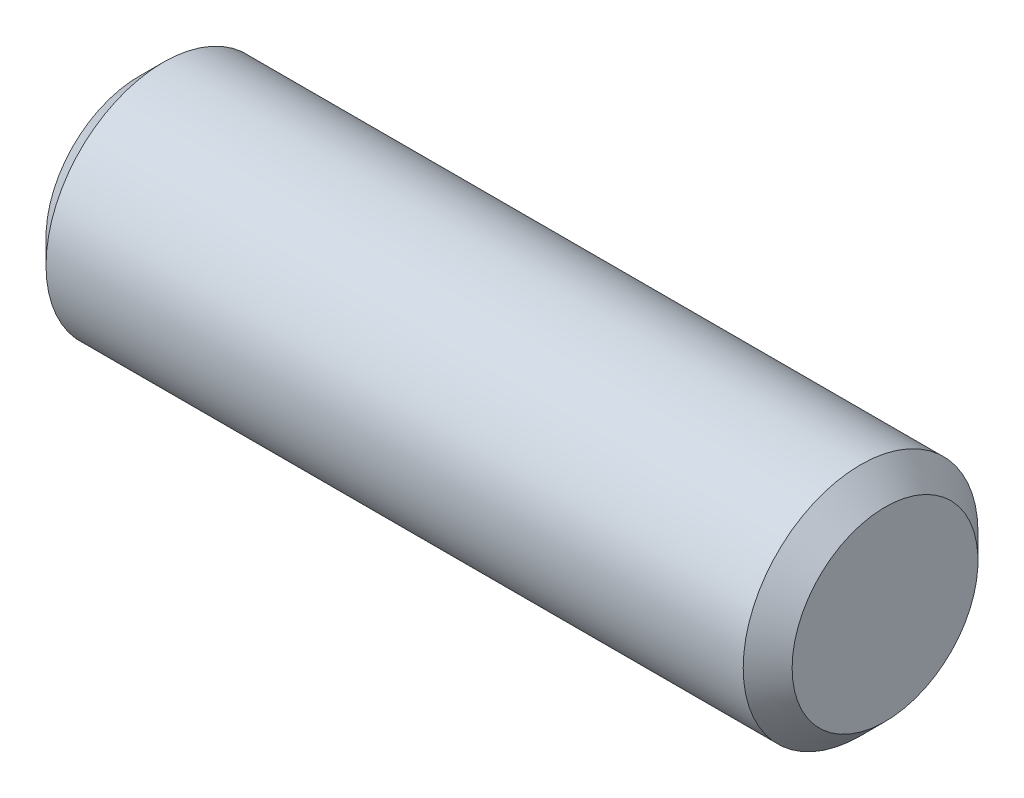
from build123d import *

# Parameters (mm, degrees)
SKETCH1_W     = 7.747
SKETCH1_H     = 1.219
CHAMFER1_SIZE = 0.254


with BuildPart() as part:
    # Sketch1 → Revolve1 (revolve)
    with BuildSketch(Plane.XY, mode=Mode.PRIVATE) as revolve1_sk:
        with Locations((3.8735, 0.6095)):
            Rectangle(SKETCH1_W, SKETCH1_H)
    revolve(revolve1_sk.sketch.rotate(Axis((0, 0, 0), (1, 0, 0)), 90), axis=Axis((0, 0, 0), (1, 0, 0)))

    # Chamfer1
    chamfer1_edges = [part.edges().sort_by_distance(p)[0] for p in [
        (0, 0, -1.219),
        (7.747, 0, -1.219),
    ]]
    chamfer(chamfer1_edges, length=CHAMFER1_SIZE)


solid = part.part
